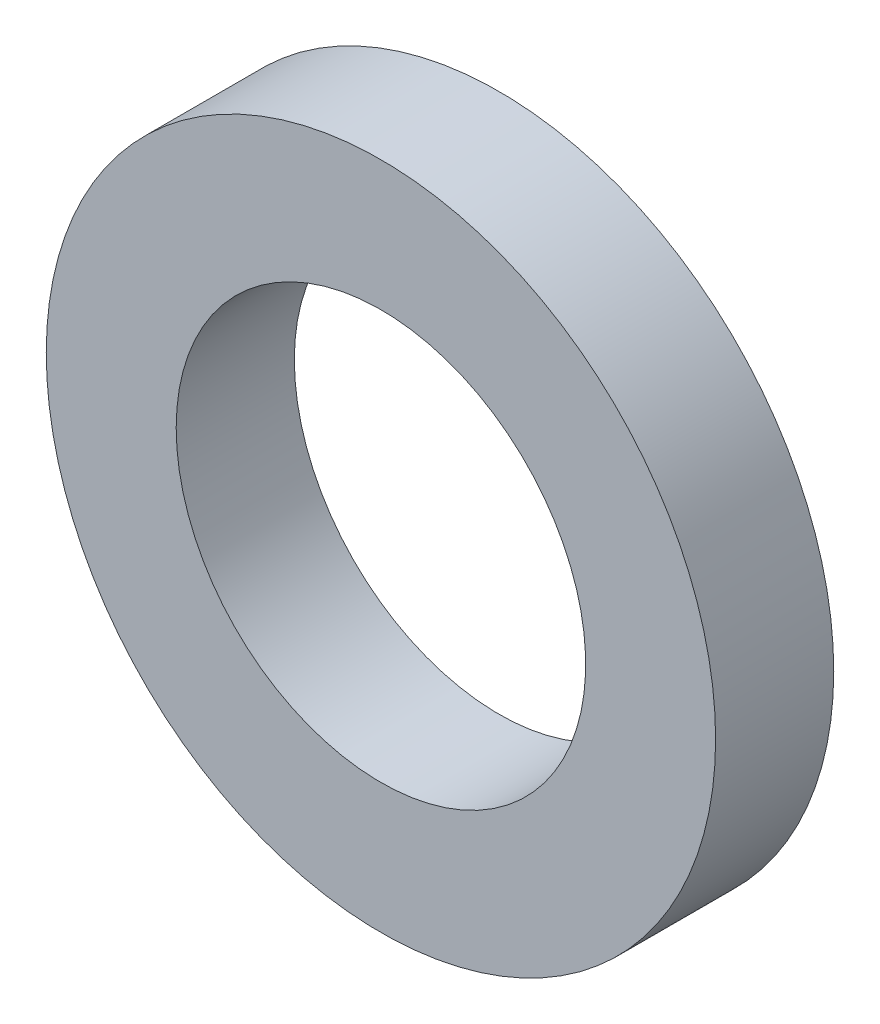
ISO-10303-21;
HEADER;
FILE_DESCRIPTION(('STEP AP214'),'2;1');
FILE_NAME('part.step','',(''),(''),'','','');
FILE_SCHEMA(('AUTOMOTIVE_DESIGN { 1 0 10303 214 1 1 1 1 }'));
ENDSEC;
DATA;
#1=APPLICATION_CONTEXT('core data for automotive mechanical design processes');
#2=APPLICATION_PROTOCOL_DEFINITION('international standard','automotive_design',2000,#1);
#3=PRODUCT_CONTEXT('',#1,'mechanical');
#4=PRODUCT('Part','Part','',(#3));
#5=PRODUCT_RELATED_PRODUCT_CATEGORY('part','',(#4));
#6=PRODUCT_DEFINITION_FORMATION('','',#4);
#7=PRODUCT_DEFINITION_CONTEXT('part definition',#1,'design');
#8=PRODUCT_DEFINITION('design','',#6,#7);
#9=PRODUCT_DEFINITION_SHAPE('','',#8);
#10=(LENGTH_UNIT() NAMED_UNIT(*) SI_UNIT(.MILLI.,.METRE.));
#11=(NAMED_UNIT(*) PLANE_ANGLE_UNIT() SI_UNIT($,.RADIAN.));
#12=(NAMED_UNIT(*) SI_UNIT($,.STERADIAN.) SOLID_ANGLE_UNIT());
#13=UNCERTAINTY_MEASURE_WITH_UNIT(LENGTH_MEASURE(1.E-05),#10,'distance_accuracy_value','');
#14=(GEOMETRIC_REPRESENTATION_CONTEXT(3) GLOBAL_UNCERTAINTY_ASSIGNED_CONTEXT((#13)) GLOBAL_UNIT_ASSIGNED_CONTEXT((#10,
#11,#12)) REPRESENTATION_CONTEXT('',''));
#15=CARTESIAN_POINT('',(0.,0.,0.));
#16=DIRECTION('',(0.,0.,1.));
#17=DIRECTION('',(1.,0.,0.));
#18=AXIS2_PLACEMENT_3D('',#15,#16,#17);
#19=CARTESIAN_POINT('',(0.,4.25,-0.75));
#20=DIRECTION('',(0.,0.,-1.));
#21=DIRECTION('',(-1.,0.,0.));
#22=AXIS2_PLACEMENT_3D('',#19,#20,#21);
#23=PLANE('',#22);
#24=CARTESIAN_POINT('',(0.,0.,-0.749999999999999));
#25=DIRECTION('',(0.,0.,-1.));
#26=DIRECTION('',(-1.,0.,0.));
#27=AXIS2_PLACEMENT_3D('',#24,#25,#26);
#28=CIRCLE('',#27,4.25);
#29=CARTESIAN_POINT('',(-4.25,0.,-0.749999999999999));
#30=VERTEX_POINT('',#29);
#31=EDGE_CURVE('E10',#30,#30,#28,.T.);
#32=ORIENTED_EDGE('',*,*,#31,.T.);
#33=EDGE_LOOP('',(#32));
#34=FACE_BOUND('',#33,.T.);
#35=CARTESIAN_POINT('',(0.,0.,-0.75));
#36=DIRECTION('',(0.,0.,-1.));
#37=DIRECTION('',(-1.,0.,0.));
#38=AXIS2_PLACEMENT_3D('',#35,#36,#37);
#39=CIRCLE('',#38,2.6);
#40=CARTESIAN_POINT('',(-2.6,0.,-0.75));
#41=VERTEX_POINT('',#40);
#42=EDGE_CURVE('E45',#41,#41,#39,.T.);
#43=ORIENTED_EDGE('',*,*,#42,.F.);
#44=EDGE_LOOP('',(#43));
#45=FACE_BOUND('',#44,.T.);
#46=ADVANCED_FACE('F31',(#34,#45),#23,.T.);
#47=CARTESIAN_POINT('',(0.,0.,0.));
#48=DIRECTION('',(0.,0.,-1.));
#49=DIRECTION('',(-1.,0.,0.));
#50=AXIS2_PLACEMENT_3D('',#47,#48,#49);
#51=CYLINDRICAL_SURFACE('',#50,4.25);
#52=CARTESIAN_POINT('',(0.,0.,0.750000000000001));
#53=DIRECTION('',(0.,0.,-1.));
#54=DIRECTION('',(-1.,0.,0.));
#55=AXIS2_PLACEMENT_3D('',#52,#53,#54);
#56=CIRCLE('',#55,4.25);
#57=CARTESIAN_POINT('',(-4.25,0.,0.750000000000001));
#58=VERTEX_POINT('',#57);
#59=EDGE_CURVE('E37',#58,#58,#56,.T.);
#60=ORIENTED_EDGE('',*,*,#59,.T.);
#61=EDGE_LOOP('',(#60));
#62=FACE_BOUND('',#61,.T.);
#63=ORIENTED_EDGE('',*,*,#31,.F.);
#64=EDGE_LOOP('',(#63));
#65=FACE_BOUND('',#64,.T.);
#66=ADVANCED_FACE('F55',(#62,#65),#51,.T.);
#67=CARTESIAN_POINT('',(0.,4.25,0.75));
#68=DIRECTION('',(0.,0.,1.));
#69=DIRECTION('',(1.,0.,0.));
#70=AXIS2_PLACEMENT_3D('',#67,#68,#69);
#71=PLANE('',#70);
#72=CARTESIAN_POINT('',(0.,0.,0.75));
#73=DIRECTION('',(0.,0.,-1.));
#74=DIRECTION('',(-1.,0.,0.));
#75=AXIS2_PLACEMENT_3D('',#72,#73,#74);
#76=CIRCLE('',#75,2.6);
#77=CARTESIAN_POINT('',(-2.6,0.,0.75));
#78=VERTEX_POINT('',#77);
#79=EDGE_CURVE('E41',#78,#78,#76,.T.);
#80=ORIENTED_EDGE('',*,*,#79,.T.);
#81=EDGE_LOOP('',(#80));
#82=FACE_BOUND('',#81,.T.);
#83=ORIENTED_EDGE('',*,*,#59,.F.);
#84=EDGE_LOOP('',(#83));
#85=FACE_BOUND('',#84,.T.);
#86=ADVANCED_FACE('F59',(#82,#85),#71,.T.);
#87=CARTESIAN_POINT('',(0.,0.,0.));
#88=DIRECTION('',(0.,0.,-1.));
#89=DIRECTION('',(-1.,0.,0.));
#90=AXIS2_PLACEMENT_3D('',#87,#88,#89);
#91=CYLINDRICAL_SURFACE('',#90,2.6);
#92=ORIENTED_EDGE('',*,*,#42,.T.);
#93=EDGE_LOOP('',(#92));
#94=FACE_BOUND('',#93,.T.);
#95=ORIENTED_EDGE('',*,*,#79,.F.);
#96=EDGE_LOOP('',(#95));
#97=FACE_BOUND('',#96,.T.);
#98=ADVANCED_FACE('F51',(#94,#97),#91,.F.);
#99=CLOSED_SHELL('',(#46,#66,#86,#98));
#100=MANIFOLD_SOLID_BREP('B2',#99);
#101=ADVANCED_BREP_SHAPE_REPRESENTATION('',(#18,#100),#14);
#102=SHAPE_DEFINITION_REPRESENTATION(#9,#101);
ENDSEC;
END-ISO-10303-21;
